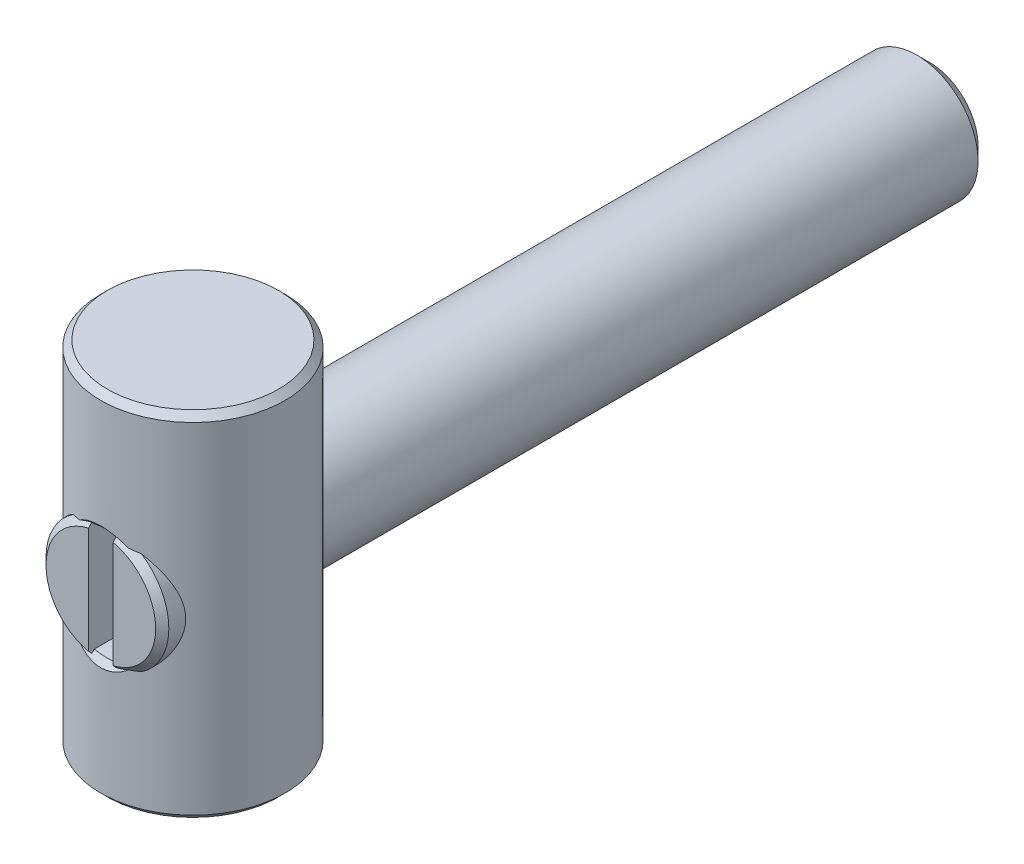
ISO-10303-21;
HEADER;
FILE_DESCRIPTION(('STEP AP214'),'2;1');
FILE_NAME('part.step','',(''),(''),'','','');
FILE_SCHEMA(('AUTOMOTIVE_DESIGN { 1 0 10303 214 1 1 1 1 }'));
ENDSEC;
DATA;
#1=APPLICATION_CONTEXT('core data for automotive mechanical design processes');
#2=APPLICATION_PROTOCOL_DEFINITION('international standard','automotive_design',2000,#1);
#3=PRODUCT_CONTEXT('',#1,'mechanical');
#4=PRODUCT('Part','Part','',(#3));
#5=PRODUCT_RELATED_PRODUCT_CATEGORY('part','',(#4));
#6=PRODUCT_DEFINITION_FORMATION('','',#4);
#7=PRODUCT_DEFINITION_CONTEXT('part definition',#1,'design');
#8=PRODUCT_DEFINITION('design','',#6,#7);
#9=PRODUCT_DEFINITION_SHAPE('','',#8);
#10=(LENGTH_UNIT() NAMED_UNIT(*) SI_UNIT(.MILLI.,.METRE.));
#11=(NAMED_UNIT(*) PLANE_ANGLE_UNIT() SI_UNIT($,.RADIAN.));
#12=(NAMED_UNIT(*) SI_UNIT($,.STERADIAN.) SOLID_ANGLE_UNIT());
#13=UNCERTAINTY_MEASURE_WITH_UNIT(LENGTH_MEASURE(1.E-05),#10,'distance_accuracy_value','');
#14=(GEOMETRIC_REPRESENTATION_CONTEXT(3) GLOBAL_UNCERTAINTY_ASSIGNED_CONTEXT((#13)) GLOBAL_UNIT_ASSIGNED_CONTEXT((#10,
#11,#12)) REPRESENTATION_CONTEXT('',''));
#15=CARTESIAN_POINT('',(0.,0.,0.));
#16=DIRECTION('',(0.,0.,1.));
#17=DIRECTION('',(1.,0.,0.));
#18=AXIS2_PLACEMENT_3D('',#15,#16,#17);
#19=CARTESIAN_POINT('',(0.,0.,-4.));
#20=DIRECTION('',(0.,0.,-1.));
#21=DIRECTION('',(-1.,0.,0.));
#22=AXIS2_PLACEMENT_3D('',#19,#20,#21);
#23=CYLINDRICAL_SURFACE('',#22,2.);
#24=CARTESIAN_POINT('',(1.11399719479,1.6610268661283,2.7855));
#25=CARTESIAN_POINT('',(1.16352046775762,1.62780404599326,2.76569630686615));
#26=CARTESIAN_POINT('',(1.21129322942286,1.59256213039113,2.74505589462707));
#27=CARTESIAN_POINT('',(1.30320814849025,1.51827100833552,2.70263011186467));
#28=CARTESIAN_POINT('',(1.34735150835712,1.47922307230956,2.68084512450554));
#29=CARTESIAN_POINT('',(1.47484746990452,1.35604681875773,2.61420147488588));
#30=CARTESIAN_POINT('',(1.55249324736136,1.26640812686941,2.56837763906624));
#31=CARTESIAN_POINT('',(1.69127884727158,1.07409237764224,2.47919034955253));
#32=CARTESIAN_POINT('',(1.75241552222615,0.971412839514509,2.43582736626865));
#33=CARTESIAN_POINT('',(1.85615019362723,0.754349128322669,2.35773638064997));
#34=CARTESIAN_POINT('',(1.89882852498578,0.640018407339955,2.32297124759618));
#35=CARTESIAN_POINT('',(1.95314493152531,0.438747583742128,2.27729599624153));
#36=CARTESIAN_POINT('',(1.97029467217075,0.354216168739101,2.26233654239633));
#37=CARTESIAN_POINT('',(1.99352675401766,0.182551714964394,2.24189698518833));
#38=CARTESIAN_POINT('',(1.99962325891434,0.0954221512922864,2.23640475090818));
#39=CARTESIAN_POINT('',(2.00034328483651,-0.079061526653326,2.23576112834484));
#40=CARTESIAN_POINT('',(1.99494860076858,-0.166415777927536,2.24062614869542));
#41=CARTESIAN_POINT('',(1.97303463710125,-0.338667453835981,2.25994148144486));
#42=CARTESIAN_POINT('',(1.95650152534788,-0.423561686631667,2.27440371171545));
#43=CARTESIAN_POINT('',(1.90813577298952,-0.608419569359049,2.31521704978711));
#44=CARTESIAN_POINT('',(1.87361856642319,-0.707228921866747,2.34356486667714));
#45=CARTESIAN_POINT('',(1.79082971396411,-0.8964602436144,2.40741595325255));
#46=CARTESIAN_POINT('',(1.7425316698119,-0.986865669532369,2.44293291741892));
#47=CARTESIAN_POINT('',(1.63252243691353,-1.15999565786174,2.51781416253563));
#48=CARTESIAN_POINT('',(1.57057489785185,-1.2425426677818,2.55723849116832));
#49=CARTESIAN_POINT('',(1.43480463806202,-1.39709631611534,2.63580434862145));
#50=CARTESIAN_POINT('',(1.36100810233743,-1.46912554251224,2.67494630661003));
#51=CARTESIAN_POINT('',(1.25497641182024,-1.55764120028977,2.72505273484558));
#52=CARTESIAN_POINT('',(1.22762940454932,-1.57928737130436,2.73749131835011));
#53=CARTESIAN_POINT('',(1.17172197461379,-1.62119899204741,2.76188255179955));
#54=CARTESIAN_POINT('',(1.14316238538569,-1.64146536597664,2.77383552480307));
#55=CARTESIAN_POINT('',(1.11399719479,-1.6610268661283,2.7855));
#56=B_SPLINE_CURVE_WITH_KNOTS('',3,(#24,#25,#26,#27,#28,#29,#30,#31,#32,#33,#34,#35,#36,#37,#38,
#39,#40,#41,#42,#43,#44,#45,#46,#47,#48,#49,#50,#51,#52,#53,#54,#55),.UNSPECIFIED.,.F.,.F.,(4,2,
2,2,2,2,2,2,2,2,2,2,2,2,2,4),(0.,0.188362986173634,0.376663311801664,0.756187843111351,
1.135784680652,1.51371238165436,1.77524600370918,2.03644425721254,2.29805662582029,
2.55999447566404,2.88356492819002,3.20775941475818,3.5380838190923,3.86768804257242,
3.97873730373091,4.08971143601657),.UNSPECIFIED.);
#57=CARTESIAN_POINT('',(1.11399719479,1.6610268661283,2.7855));
#58=VERTEX_POINT('',#57);
#59=CARTESIAN_POINT('',(1.11399719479,-1.6610268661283,2.7855));
#60=VERTEX_POINT('',#59);
#61=EDGE_CURVE('E230',#58,#60,#56,.T.);
#62=ORIENTED_EDGE('',*,*,#61,.F.);
#63=CARTESIAN_POINT('',(0.,0.,2.7855));
#64=DIRECTION('',(0.,0.,-1.));
#65=DIRECTION('',(-1.,0.,0.));
#66=AXIS2_PLACEMENT_3D('',#63,#64,#65);
#67=CIRCLE('',#66,2.);
#68=EDGE_CURVE('E125',#58,#60,#67,.T.);
#69=ORIENTED_EDGE('',*,*,#68,.T.);
#70=EDGE_LOOP('',(#62,#69));
#71=FACE_BOUND('',#70,.T.);
#72=ADVANCED_FACE('F14',(#71),#23,.T.);
#73=CARTESIAN_POINT('',(0.,0.,3.));
#74=DIRECTION('',(0.,0.,-1.));
#75=DIRECTION('',(-1.,0.,0.));
#76=AXIS2_PLACEMENT_3D('',#73,#74,#75);
#77=PLANE('',#76);
#78=DIRECTION('',(0.,-1.,0.));
#79=VECTOR('',#78,1.);
#80=CARTESIAN_POINT('',(-0.4,0.,3.));
#81=LINE('',#80,#79);
#82=CARTESIAN_POINT('',(-0.4,1.74011788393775,3.));
#83=VERTEX_POINT('',#82);
#84=CARTESIAN_POINT('',(-0.4,-1.74011788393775,3.));
#85=VERTEX_POINT('',#84);
#86=EDGE_CURVE('E110',#83,#85,#81,.T.);
#87=ORIENTED_EDGE('',*,*,#86,.F.);
#88=CARTESIAN_POINT('',(0.,0.,3.));
#89=DIRECTION('',(0.,0.,-1.));
#90=DIRECTION('',(-1.,0.,0.));
#91=AXIS2_PLACEMENT_3D('',#88,#89,#90);
#92=CIRCLE('',#91,1.7855);
#93=EDGE_CURVE('E121',#85,#83,#92,.T.);
#94=ORIENTED_EDGE('',*,*,#93,.F.);
#95=EDGE_LOOP('',(#87,#94));
#96=FACE_BOUND('',#95,.T.);
#97=ADVANCED_FACE('F120',(#96),#77,.F.);
#98=CARTESIAN_POINT('',(0.,0.,3.));
#99=DIRECTION('',(0.,0.,-1.));
#100=DIRECTION('',(-1.,0.,0.));
#101=AXIS2_PLACEMENT_3D('',#98,#99,#100);
#102=CONICAL_SURFACE('',#101,1.7855,0.785398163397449);
#103=CARTESIAN_POINT('',(-1.16667612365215,1.65104074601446,2.76385));
#104=CARTESIAN_POINT('',(-1.09329916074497,1.66504476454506,2.79481750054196));
#105=CARTESIAN_POINT('',(-1.01868995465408,1.67914160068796,2.82287437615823));
#106=CARTESIAN_POINT('',(-0.86782079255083,1.70596914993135,2.87283254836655));
#107=CARTESIAN_POINT('',(-0.791576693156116,1.7187090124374,2.89477692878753));
#108=CARTESIAN_POINT('',(-0.637125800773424,1.74152361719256,2.93264181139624));
#109=CARTESIAN_POINT('',(-0.558917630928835,1.75159642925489,2.94855795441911));
#110=CARTESIAN_POINT('',(-0.440293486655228,1.76402293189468,2.96778774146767));
#111=CARTESIAN_POINT('',(-0.400383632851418,1.76772662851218,2.97343575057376));
#112=CARTESIAN_POINT('',(-0.320283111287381,1.77413676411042,2.98312696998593));
#113=CARTESIAN_POINT('',(-0.280092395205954,1.77684302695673,2.98716989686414));
#114=CARTESIAN_POINT('',(-0.2398,1.77901031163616,2.99040063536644));
#115=B_SPLINE_CURVE_WITH_KNOTS('',3,(#103,#104,#105,#106,#107,#108,#109,#110,#111,#112,#113,
#114),.UNSPECIFIED.,.F.,.F.,(4,2,2,2,2,4),(0.,0.242566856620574,0.483378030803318,
0.724363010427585,0.845755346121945,0.967169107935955),.UNSPECIFIED.);
#116=CARTESIAN_POINT('',(-1.11399719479,1.6610268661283,2.7855));
#117=VERTEX_POINT('',#116);
#118=CARTESIAN_POINT('',(-0.794982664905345,1.71770344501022,2.89275));
#119=VERTEX_POINT('',#118);
#120=EDGE_CURVE('E9',#117,#119,#115,.T.);
#121=ORIENTED_EDGE('',*,*,#120,.F.);
#122=CARTESIAN_POINT('',(-1.11399719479,-1.6610268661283,2.7855));
#123=VERTEX_POINT('',#122);
#124=EDGE_CURVE('E130',#123,#117,#67,.T.);
#125=ORIENTED_EDGE('',*,*,#124,.F.);
#126=CARTESIAN_POINT('',(-0.2398,-1.77901031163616,2.99040063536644));
#127=CARTESIAN_POINT('',(-0.280092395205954,-1.77684302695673,2.98716989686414));
#128=CARTESIAN_POINT('',(-0.320283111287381,-1.77413676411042,2.98312696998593));
#129=CARTESIAN_POINT('',(-0.400383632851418,-1.76772662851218,2.97343575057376));
#130=CARTESIAN_POINT('',(-0.440293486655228,-1.76402293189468,2.96778774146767));
#131=CARTESIAN_POINT('',(-0.558917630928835,-1.75159642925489,2.94855795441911));
#132=CARTESIAN_POINT('',(-0.637125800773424,-1.74152361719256,2.93264181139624));
#133=CARTESIAN_POINT('',(-0.791576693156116,-1.7187090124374,2.89477692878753));
#134=CARTESIAN_POINT('',(-0.86782079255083,-1.70596914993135,2.87283254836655));
#135=CARTESIAN_POINT('',(-1.01868995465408,-1.67914160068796,2.82287437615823));
#136=CARTESIAN_POINT('',(-1.09329916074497,-1.66504476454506,2.79481750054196));
#137=CARTESIAN_POINT('',(-1.16667612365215,-1.65104074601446,2.76385));
#138=B_SPLINE_CURVE_WITH_KNOTS('',3,(#126,#127,#128,#129,#130,#131,#132,#133,#134,#135,#136,
#137),.UNSPECIFIED.,.F.,.F.,(4,2,2,2,2,4),(0.,0.12141376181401,0.24280609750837,
0.483791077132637,0.724602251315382,0.967169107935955),.UNSPECIFIED.);
#139=CARTESIAN_POINT('',(-0.794982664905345,-1.71770344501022,2.89275));
#140=VERTEX_POINT('',#139);
#141=EDGE_CURVE('E40',#140,#123,#138,.T.);
#142=ORIENTED_EDGE('',*,*,#141,.F.);
#143=CARTESIAN_POINT('',(0.,0.,2.89275));
#144=DIRECTION('',(0.,0.,1.));
#145=DIRECTION('',(1.,0.,0.));
#146=AXIS2_PLACEMENT_3D('',#143,#144,#145);
#147=CIRCLE('',#146,1.89275);
#148=CARTESIAN_POINT('',(-0.4,-1.85000069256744,2.89275));
#149=VERTEX_POINT('',#148);
#150=EDGE_CURVE('E196',#140,#149,#147,.T.);
#151=ORIENTED_EDGE('',*,*,#150,.T.);
#152=CARTESIAN_POINT('',(-0.4,1.96030622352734,2.7848));
#153=CARTESIAN_POINT('',(-0.4,1.91220040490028,2.83193265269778));
#154=CARTESIAN_POINT('',(-0.4,1.86406179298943,2.87903187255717));
#155=CARTESIAN_POINT('',(-0.4,1.76762008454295,2.97321655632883));
#156=CARTESIAN_POINT('',(-0.4,1.71931684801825,3.02030187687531));
#157=CARTESIAN_POINT('',(-0.4,1.6212885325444,3.11563710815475));
#158=CARTESIAN_POINT('',(-0.4,1.5715604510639,3.16388393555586));
#159=CARTESIAN_POINT('',(-0.4,1.47203148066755,3.26014103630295));
#160=CARTESIAN_POINT('',(-0.4,1.42223083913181,3.30815156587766));
#161=CARTESIAN_POINT('',(-0.4,1.27910635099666,3.44557059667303));
#162=CARTESIAN_POINT('',(-0.4,1.18553880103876,3.53472711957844));
#163=CARTESIAN_POINT('',(-0.4,1.04389226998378,3.66771074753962));
#164=CARTESIAN_POINT('',(-0.4,0.996302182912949,3.71205806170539));
#165=CARTESIAN_POINT('',(-0.4,0.900663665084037,3.80018516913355));
#166=CARTESIAN_POINT('',(-0.4,0.852615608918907,3.84396536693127));
#167=CARTESIAN_POINT('',(-0.4,0.757010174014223,3.9295656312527));
#168=CARTESIAN_POINT('',(-0.4,0.709472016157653,3.97140714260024));
#169=CARTESIAN_POINT('',(-0.4,0.613103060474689,4.05388760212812));
#170=CARTESIAN_POINT('',(-0.4,0.564268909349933,4.0945227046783));
#171=CARTESIAN_POINT('',(-0.4,0.489794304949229,4.15330063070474));
#172=CARTESIAN_POINT('',(-0.4,0.464926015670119,4.17241703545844));
#173=CARTESIAN_POINT('',(-0.4,0.414504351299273,4.2097188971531));
#174=CARTESIAN_POINT('',(-0.4,0.388951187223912,4.22790463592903));
#175=CARTESIAN_POINT('',(-0.4,0.337021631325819,4.26280071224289));
#176=CARTESIAN_POINT('',(-0.4,0.310649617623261,4.27951751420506));
#177=CARTESIAN_POINT('',(-0.4,0.25664656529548,4.31075573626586));
#178=CARTESIAN_POINT('',(-0.4,0.229017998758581,4.32528124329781));
#179=CARTESIAN_POINT('',(-0.4,0.194529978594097,4.34073824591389));
#180=CARTESIAN_POINT('',(-0.4,0.188431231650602,4.34337414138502));
#181=CARTESIAN_POINT('',(-0.4,0.176155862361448,4.34846503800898));
#182=CARTESIAN_POINT('',(-0.4,0.169979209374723,4.35091996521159));
#183=CARTESIAN_POINT('',(-0.4,0.151336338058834,4.35798334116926));
#184=CARTESIAN_POINT('',(-0.4,0.138753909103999,4.36229188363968));
#185=CARTESIAN_POINT('',(-0.4,0.113503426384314,4.36987933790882));
#186=CARTESIAN_POINT('',(-0.4,0.100840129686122,4.37317392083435));
#187=CARTESIAN_POINT('',(-0.4,0.0752707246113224,4.37867100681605));
#188=CARTESIAN_POINT('',(-0.4,0.0623645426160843,4.38087317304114));
#189=CARTESIAN_POINT('',(-0.4,0.0361451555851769,4.38408457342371));
#190=CARTESIAN_POINT('',(-0.4,0.0228289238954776,4.38506967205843));
#191=CARTESIAN_POINT('',(-0.4,-0.00382941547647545,4.38570474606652));
#192=CARTESIAN_POINT('',(-0.4,-0.0171715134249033,4.38535515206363));
#193=CARTESIAN_POINT('',(-0.4,-0.0570913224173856,4.38231129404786));
#194=CARTESIAN_POINT('',(-0.4,-0.0835282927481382,4.37761777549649));
#195=CARTESIAN_POINT('',(-0.4,-0.144402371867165,4.36159805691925));
#196=CARTESIAN_POINT('',(-0.4,-0.178344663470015,4.34850779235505));
#197=CARTESIAN_POINT('',(-0.4,-0.227667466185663,4.32547752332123));
#198=CARTESIAN_POINT('',(-0.4,-0.243900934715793,4.31719757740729));
#199=CARTESIAN_POINT('',(-0.4,-0.275892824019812,4.29976597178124));
#200=CARTESIAN_POINT('',(-0.4,-0.291651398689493,4.29061459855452));
#201=CARTESIAN_POINT('',(-0.4,-0.342427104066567,4.25969743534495));
#202=CARTESIAN_POINT('',(-0.4,-0.376624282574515,4.23660064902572));
#203=CARTESIAN_POINT('',(-0.4,-0.443707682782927,4.18856142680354));
#204=CARTESIAN_POINT('',(-0.4,-0.476592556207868,4.16361716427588));
#205=CARTESIAN_POINT('',(-0.4,-0.541555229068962,4.11253731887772));
#206=CARTESIAN_POINT('',(-0.4,-0.573630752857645,4.08639885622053));
#207=CARTESIAN_POINT('',(-0.4,-0.637167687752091,4.03338342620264));
#208=CARTESIAN_POINT('',(-0.4,-0.668629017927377,4.00650636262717));
#209=CARTESIAN_POINT('',(-0.4,-0.762581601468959,3.92494921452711));
#210=CARTESIAN_POINT('',(-0.4,-0.824422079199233,3.86952173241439));
#211=CARTESIAN_POINT('',(-0.4,-0.947059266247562,3.75773288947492));
#212=CARTESIAN_POINT('',(-0.4,-1.00785750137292,3.70137318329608));
#213=CARTESIAN_POINT('',(-0.4,-1.14419995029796,3.57369126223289));
#214=CARTESIAN_POINT('',(-0.4,-1.21957997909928,3.50219383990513));
#215=CARTESIAN_POINT('',(-0.4,-1.36985690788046,3.35860627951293));
#216=CARTESIAN_POINT('',(-0.4,-1.44475349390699,3.28651581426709));
#217=CARTESIAN_POINT('',(-0.4,-1.59323885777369,3.1429244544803));
#218=CARTESIAN_POINT('',(-0.4,-1.66683198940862,3.07142805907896));
#219=CARTESIAN_POINT('',(-0.4,-1.81374089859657,2.92824339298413));
#220=CARTESIAN_POINT('',(-0.4,-1.88705682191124,2.85655527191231));
#221=CARTESIAN_POINT('',(-0.4,-1.96030622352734,2.7848));
#222=B_SPLINE_CURVE_WITH_KNOTS('',3,(#152,#153,#154,#155,#156,#157,#158,#159,#160,#161,#162,
#163,#164,#165,#166,#167,#168,#169,#170,#171,#172,#173,#174,#175,#176,#177,#178,#179,#180,#181,
#182,#183,#184,#185,#186,#187,#188,#189,#190,#191,#192,#193,#194,#195,#196,#197,#198,#199,#200,
#201,#202,#203,#204,#205,#206,#207,#208,#209,#210,#211,#212,#213,#214,#215,#216,#217,#218,#219,
#220,#221),.UNSPECIFIED.,.F.,.F.,(4,2,2,2,2,2,2,2,2,2,2,2,2,2,2,2,2,2,2,2,2,2,2,2,2,2,2,2,2,2,2,
2,2,2,4),(0.,0.202041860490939,0.404407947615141,0.612267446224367,0.819791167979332,
1.20751042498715,1.40265824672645,1.59765821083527,1.78763722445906,1.97816800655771,
2.07225481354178,2.16631295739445,2.25993394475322,2.35337810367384,2.37330754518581,
2.39324508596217,2.43310931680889,2.47232228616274,2.51154733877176,2.5515383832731,
2.59151652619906,2.67157438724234,2.78007616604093,2.83473709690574,2.88938011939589,
3.0130530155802,3.13684986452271,3.26096287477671,3.38509213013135,3.63419872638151,
3.88290259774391,4.19457948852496,4.50644172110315,4.8142545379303,5.12187303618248),.UNSPECIFIED.);
#223=EDGE_CURVE('E117',#85,#149,#222,.T.);
#224=ORIENTED_EDGE('',*,*,#223,.F.);
#225=ORIENTED_EDGE('',*,*,#93,.T.);
#226=CARTESIAN_POINT('',(-0.4,1.85000069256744,2.89275));
#227=VERTEX_POINT('',#226);
#228=EDGE_CURVE('E106',#227,#83,#222,.T.);
#229=ORIENTED_EDGE('',*,*,#228,.F.);
#230=CARTESIAN_POINT('',(0.,0.,2.89275));
#231=DIRECTION('',(0.,0.,1.));
#232=DIRECTION('',(1.,0.,0.));
#233=AXIS2_PLACEMENT_3D('',#230,#231,#232);
#234=CIRCLE('',#233,1.89275);
#235=EDGE_CURVE('E28',#227,#119,#234,.T.);
#236=ORIENTED_EDGE('',*,*,#235,.T.);
#237=EDGE_LOOP('',(#121,#125,#142,#151,#224,#225,#229,#236));
#238=FACE_BOUND('',#237,.T.);
#239=ADVANCED_FACE('F123',(#238),#102,.T.);
#240=CARTESIAN_POINT('',(0.4,0.,33.));
#241=DIRECTION('',(-1.,0.,0.));
#242=DIRECTION('',(0.,-1.,0.));
#243=AXIS2_PLACEMENT_3D('',#240,#241,#242);
#244=CYLINDRICAL_SURFACE('',#243,31.5);
#245=CARTESIAN_POINT('',(0.4,-1.76576053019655,1.54952957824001));
#246=CARTESIAN_POINT('',(0.349977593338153,-1.77709824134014,1.55016706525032));
#247=CARTESIAN_POINT('',(0.299469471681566,-1.78629930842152,1.55068890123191));
#248=CARTESIAN_POINT('',(0.197847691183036,-1.80038671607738,1.55149171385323));
#249=CARTESIAN_POINT('',(0.146733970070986,-1.8052726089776,1.55177266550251));
#250=CARTESIAN_POINT('',(0.0452193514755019,-1.81063609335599,1.55208115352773));
#251=CARTESIAN_POINT('',(-0.00517737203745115,-1.81119308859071,1.55211325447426));
#252=CARTESIAN_POINT('',(-0.105833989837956,-1.80810483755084,1.55193550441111));
#253=CARTESIAN_POINT('',(-0.156093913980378,-1.8044605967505,1.55172571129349));
#254=CARTESIAN_POINT('',(-0.238696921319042,-1.79499603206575,1.5511843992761));
#255=CARTESIAN_POINT('',(-0.271182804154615,-1.7903758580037,1.55092073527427));
#256=CARTESIAN_POINT('',(-0.335843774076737,-1.77938039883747,1.55029676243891));
#257=CARTESIAN_POINT('',(-0.368018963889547,-1.77300571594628,1.5499364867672));
#258=CARTESIAN_POINT('',(-0.4,-1.76576053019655,1.54952957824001));
#259=B_SPLINE_CURVE_WITH_KNOTS('',3,(#245,#246,#247,#248,#249,#250,#251,#252,#253,#254,#255,
#256,#257,#258),.UNSPECIFIED.,.F.,.F.,(4,2,2,2,2,2,4),(0.,0.153839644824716,0.307695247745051,
0.458721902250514,0.609712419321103,0.708108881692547,0.806471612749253),.UNSPECIFIED.);
#260=CARTESIAN_POINT('',(0.4,-1.76576053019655,1.54952957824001));
#261=VERTEX_POINT('',#260);
#262=CARTESIAN_POINT('',(-0.4,-1.76576053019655,1.54952957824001));
#263=VERTEX_POINT('',#262);
#264=EDGE_CURVE('E345',#261,#263,#259,.T.);
#265=ORIENTED_EDGE('',*,*,#264,.F.);
#266=CARTESIAN_POINT('',(0.4,0.,33.));
#267=DIRECTION('',(1.,0.,0.));
#268=DIRECTION('',(0.,1.,0.));
#269=AXIS2_PLACEMENT_3D('',#266,#267,#268);
#270=CIRCLE('',#269,31.5);
#271=CARTESIAN_POINT('',(0.4,1.76576053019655,1.54952957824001));
#272=VERTEX_POINT('',#271);
#273=EDGE_CURVE('E115',#261,#272,#270,.T.);
#274=ORIENTED_EDGE('',*,*,#273,.T.);
#275=CARTESIAN_POINT('',(-0.4,1.76576053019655,1.54952957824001));
#276=CARTESIAN_POINT('',(-0.349977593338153,1.77709824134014,1.55016706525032));
#277=CARTESIAN_POINT('',(-0.299469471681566,1.78629930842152,1.55068890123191));
#278=CARTESIAN_POINT('',(-0.197847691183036,1.80038671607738,1.55149171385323));
#279=CARTESIAN_POINT('',(-0.146733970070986,1.8052726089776,1.55177266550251));
#280=CARTESIAN_POINT('',(-0.0452193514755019,1.81063609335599,1.55208115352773));
#281=CARTESIAN_POINT('',(0.00517737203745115,1.81119308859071,1.55211325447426));
#282=CARTESIAN_POINT('',(0.105833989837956,1.80810483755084,1.55193550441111));
#283=CARTESIAN_POINT('',(0.156093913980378,1.8044605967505,1.55172571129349));
#284=CARTESIAN_POINT('',(0.238696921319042,1.79499603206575,1.5511843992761));
#285=CARTESIAN_POINT('',(0.271182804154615,1.7903758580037,1.55092073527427));
#286=CARTESIAN_POINT('',(0.335843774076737,1.77938039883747,1.55029676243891));
#287=CARTESIAN_POINT('',(0.368018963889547,1.77300571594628,1.5499364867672));
#288=CARTESIAN_POINT('',(0.4,1.76576053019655,1.54952957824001));
#289=B_SPLINE_CURVE_WITH_KNOTS('',3,(#275,#276,#277,#278,#279,#280,#281,#282,#283,#284,#285,
#286,#287,#288),.UNSPECIFIED.,.F.,.F.,(4,2,2,2,2,2,4),(0.,0.153839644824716,0.307695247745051,
0.458721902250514,0.609712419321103,0.708108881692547,0.806471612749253),.UNSPECIFIED.);
#290=CARTESIAN_POINT('',(-0.4,1.76576053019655,1.54952957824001));
#291=VERTEX_POINT('',#290);
#292=EDGE_CURVE('E194',#291,#272,#289,.T.);
#293=ORIENTED_EDGE('',*,*,#292,.F.);
#294=CARTESIAN_POINT('',(-0.4,0.,33.));
#295=DIRECTION('',(1.,0.,0.));
#296=DIRECTION('',(0.,1.,0.));
#297=AXIS2_PLACEMENT_3D('',#294,#295,#296);
#298=CIRCLE('',#297,31.5);
#299=EDGE_CURVE('E291',#263,#291,#298,.T.);
#300=ORIENTED_EDGE('',*,*,#299,.F.);
#301=EDGE_LOOP('',(#265,#274,#293,#300));
#302=FACE_BOUND('',#301,.T.);
#303=ADVANCED_FACE('F279',(#302),#244,.F.);
#304=CARTESIAN_POINT('',(-0.4,0.,33.));
#305=DIRECTION('',(1.,0.,0.));
#306=DIRECTION('',(0.,1.,0.));
#307=AXIS2_PLACEMENT_3D('',#304,#305,#306);
#308=PLANE('',#307);
#309=CARTESIAN_POINT('',(-0.4,-1.02034635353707,2.09595012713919));
#310=CARTESIAN_POINT('',(-0.4,-1.05950736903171,2.13241722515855));
#311=CARTESIAN_POINT('',(-0.4,-1.09853653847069,2.16902508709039));
#312=CARTESIAN_POINT('',(-0.4,-1.17638543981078,2.24246200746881));
#313=CARTESIAN_POINT('',(-0.4,-1.21520517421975,2.2792910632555));
#314=CARTESIAN_POINT('',(-0.4,-1.33143077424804,2.39001871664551));
#315=CARTESIAN_POINT('',(-0.4,-1.40860528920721,2.46415991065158));
#316=CARTESIAN_POINT('',(-0.4,-1.56257008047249,2.6128326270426));
#317=CARTESIAN_POINT('',(-0.4,-1.6393603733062,2.6873641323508));
#318=CARTESIAN_POINT('',(-0.4,-1.79268710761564,2.83668891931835));
#319=CARTESIAN_POINT('',(-0.4,-1.86922354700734,2.91148220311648));
#320=CARTESIAN_POINT('',(-0.4,-2.0533689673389,3.0918524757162));
#321=CARTESIAN_POINT('',(-0.4,-2.16089223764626,3.19751690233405));
#322=CARTESIAN_POINT('',(-0.4,-2.37571065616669,3.40908334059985));
#323=CARTESIAN_POINT('',(-0.4,-2.48300579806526,3.51498535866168));
#324=CARTESIAN_POINT('',(-0.4,-2.59024265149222,3.62094582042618));
#325=B_SPLINE_CURVE_WITH_KNOTS('',3,(#309,#310,#311,#312,#313,#314,#315,#316,#317,#318,#319,
#320,#321,#322,#323,#324),.UNSPECIFIED.,.F.,.F.,(4,2,2,2,2,2,2,4),(0.,0.160532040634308,
0.321062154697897,0.64211312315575,0.963150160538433,1.2841898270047,1.73644596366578,
2.18871445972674),.UNSPECIFIED.);
#326=CARTESIAN_POINT('',(-0.4,-1.76576053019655,2.8105));
#327=VERTEX_POINT('',#326);
#328=EDGE_CURVE('E180',#327,#149,#325,.T.);
#329=ORIENTED_EDGE('',*,*,#328,.F.);
#330=DIRECTION('',(0.,0.,-1.));
#331=VECTOR('',#330,1.);
#332=CARTESIAN_POINT('',(-0.4,-1.76576053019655,-3.));
#333=LINE('',#332,#331);
#334=EDGE_CURVE('E142',#263,#327,#333,.F.);
#335=ORIENTED_EDGE('',*,*,#334,.F.);
#336=ORIENTED_EDGE('',*,*,#299,.T.);
#337=DIRECTION('',(0.,0.,-1.));
#338=VECTOR('',#337,1.);
#339=CARTESIAN_POINT('',(-0.4,1.76576053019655,-3.));
#340=LINE('',#339,#338);
#341=CARTESIAN_POINT('',(-0.4,1.76576053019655,2.8105));
#342=VERTEX_POINT('',#341);
#343=EDGE_CURVE('E128',#342,#291,#340,.T.);
#344=ORIENTED_EDGE('',*,*,#343,.F.);
#345=CARTESIAN_POINT('',(-0.4,2.59024265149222,3.62094582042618));
#346=CARTESIAN_POINT('',(-0.4,2.46048935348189,3.49276389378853));
#347=CARTESIAN_POINT('',(-0.4,2.33066988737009,3.3646473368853));
#348=CARTESIAN_POINT('',(-0.4,2.0706621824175,3.10879920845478));
#349=CARTESIAN_POINT('',(-0.4,1.9404739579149,2.98106762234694));
#350=CARTESIAN_POINT('',(-0.4,1.74472718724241,2.78993924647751));
#351=CARTESIAN_POINT('',(-0.4,1.67939930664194,2.72630645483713));
#352=CARTESIAN_POINT('',(-0.4,1.5485207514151,2.59927137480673));
#353=CARTESIAN_POINT('',(-0.4,1.48297007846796,2.5358690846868));
#354=CARTESIAN_POINT('',(-0.4,1.35155357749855,2.40938546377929));
#355=CARTESIAN_POINT('',(-0.4,1.285687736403,2.34630414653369));
#356=CARTESIAN_POINT('',(-0.4,1.15344707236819,2.22067435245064));
#357=CARTESIAN_POINT('',(-0.4,1.08707223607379,2.15812588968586));
#358=CARTESIAN_POINT('',(-0.4,1.02034635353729,2.09595012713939));
#359=B_SPLINE_CURVE_WITH_KNOTS('',3,(#345,#346,#347,#348,#349,#350,#351,#352,#353,#354,#355,
#356,#357,#358),.UNSPECIFIED.,.F.,.F.,(4,2,2,2,2,2,4),(0.,0.54717523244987,1.09432947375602,
1.36791954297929,1.6415075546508,1.91510701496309,2.18871367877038),.UNSPECIFIED.);
#360=EDGE_CURVE('E113',#227,#342,#359,.T.);
#361=ORIENTED_EDGE('',*,*,#360,.F.);
#362=ORIENTED_EDGE('',*,*,#228,.T.);
#363=ORIENTED_EDGE('',*,*,#86,.T.);
#364=ORIENTED_EDGE('',*,*,#223,.T.);
#365=EDGE_LOOP('',(#329,#335,#336,#344,#361,#362,#363,#364));
#366=FACE_BOUND('',#365,.T.);
#367=ADVANCED_FACE('F108',(#366),#308,.T.);
#368=CARTESIAN_POINT('',(0.4,1.74011788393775,3.));
#369=VERTEX_POINT('',#368);
#370=CARTESIAN_POINT('',(0.4,-1.74011788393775,3.));
#371=VERTEX_POINT('',#370);
#372=EDGE_CURVE('E124',#369,#371,#92,.T.);
#373=ORIENTED_EDGE('',*,*,#372,.F.);
#374=DIRECTION('',(0.,-1.,0.));
#375=VECTOR('',#374,1.);
#376=CARTESIAN_POINT('',(0.4,0.,3.));
#377=LINE('',#376,#375);
#378=EDGE_CURVE('E335',#369,#371,#377,.T.);
#379=ORIENTED_EDGE('',*,*,#378,.T.);
#380=EDGE_LOOP('',(#373,#379));
#381=FACE_BOUND('',#380,.T.);
#382=ADVANCED_FACE('F280',(#381),#77,.F.);
#383=CARTESIAN_POINT('',(0.2398,1.77901031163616,2.99040063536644));
#384=CARTESIAN_POINT('',(0.280092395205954,1.77684302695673,2.98716989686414));
#385=CARTESIAN_POINT('',(0.320283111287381,1.77413676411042,2.98312696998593));
#386=CARTESIAN_POINT('',(0.400383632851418,1.76772662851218,2.97343575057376));
#387=CARTESIAN_POINT('',(0.440293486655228,1.76402293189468,2.96778774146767));
#388=CARTESIAN_POINT('',(0.558917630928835,1.75159642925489,2.94855795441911));
#389=CARTESIAN_POINT('',(0.637125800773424,1.74152361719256,2.93264181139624));
#390=CARTESIAN_POINT('',(0.791576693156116,1.7187090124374,2.89477692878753));
#391=CARTESIAN_POINT('',(0.86782079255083,1.70596914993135,2.87283254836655));
#392=CARTESIAN_POINT('',(1.01868995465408,1.67914160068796,2.82287437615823));
#393=CARTESIAN_POINT('',(1.09329916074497,1.66504476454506,2.79481750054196));
#394=CARTESIAN_POINT('',(1.16667612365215,1.65104074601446,2.76385));
#395=B_SPLINE_CURVE_WITH_KNOTS('',3,(#383,#384,#385,#386,#387,#388,#389,#390,#391,#392,#393,
#394),.UNSPECIFIED.,.F.,.F.,(4,2,2,2,2,4),(0.,0.12141376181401,0.24280609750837,
0.483791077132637,0.724602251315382,0.967169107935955),.UNSPECIFIED.);
#396=CARTESIAN_POINT('',(0.794982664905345,1.71770344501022,2.89275));
#397=VERTEX_POINT('',#396);
#398=EDGE_CURVE('E228',#397,#58,#395,.T.);
#399=ORIENTED_EDGE('',*,*,#398,.F.);
#400=CARTESIAN_POINT('',(0.,0.,2.89275));
#401=DIRECTION('',(0.,0.,1.));
#402=DIRECTION('',(1.,0.,0.));
#403=AXIS2_PLACEMENT_3D('',#400,#401,#402);
#404=CIRCLE('',#403,1.89275);
#405=CARTESIAN_POINT('',(0.4,1.85000069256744,2.89275));
#406=VERTEX_POINT('',#405);
#407=EDGE_CURVE('E225',#397,#406,#404,.T.);
#408=ORIENTED_EDGE('',*,*,#407,.T.);
#409=CARTESIAN_POINT('',(0.4,1.96030622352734,2.7848));
#410=CARTESIAN_POINT('',(0.4,1.91220040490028,2.83193265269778));
#411=CARTESIAN_POINT('',(0.4,1.86406179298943,2.87903187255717));
#412=CARTESIAN_POINT('',(0.4,1.76762008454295,2.97321655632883));
#413=CARTESIAN_POINT('',(0.4,1.71931684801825,3.02030187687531));
#414=CARTESIAN_POINT('',(0.4,1.6212885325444,3.11563710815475));
#415=CARTESIAN_POINT('',(0.4,1.5715604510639,3.16388393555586));
#416=CARTESIAN_POINT('',(0.4,1.47203148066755,3.26014103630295));
#417=CARTESIAN_POINT('',(0.4,1.42223083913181,3.30815156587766));
#418=CARTESIAN_POINT('',(0.4,1.27910635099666,3.44557059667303));
#419=CARTESIAN_POINT('',(0.4,1.18553880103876,3.53472711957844));
#420=CARTESIAN_POINT('',(0.4,1.04389226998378,3.66771074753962));
#421=CARTESIAN_POINT('',(0.4,0.996302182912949,3.71205806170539));
#422=CARTESIAN_POINT('',(0.4,0.900663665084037,3.80018516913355));
#423=CARTESIAN_POINT('',(0.4,0.852615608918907,3.84396536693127));
#424=CARTESIAN_POINT('',(0.4,0.757010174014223,3.9295656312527));
#425=CARTESIAN_POINT('',(0.4,0.709472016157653,3.97140714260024));
#426=CARTESIAN_POINT('',(0.4,0.613103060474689,4.05388760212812));
#427=CARTESIAN_POINT('',(0.4,0.564268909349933,4.0945227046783));
#428=CARTESIAN_POINT('',(0.4,0.489794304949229,4.15330063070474));
#429=CARTESIAN_POINT('',(0.4,0.464926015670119,4.17241703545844));
#430=CARTESIAN_POINT('',(0.4,0.414504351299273,4.2097188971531));
#431=CARTESIAN_POINT('',(0.4,0.388951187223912,4.22790463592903));
#432=CARTESIAN_POINT('',(0.4,0.337021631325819,4.26280071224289));
#433=CARTESIAN_POINT('',(0.4,0.310649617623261,4.27951751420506));
#434=CARTESIAN_POINT('',(0.4,0.25664656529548,4.31075573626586));
#435=CARTESIAN_POINT('',(0.4,0.229017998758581,4.32528124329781));
#436=CARTESIAN_POINT('',(0.4,0.194529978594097,4.34073824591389));
#437=CARTESIAN_POINT('',(0.4,0.188431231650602,4.34337414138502));
#438=CARTESIAN_POINT('',(0.4,0.176155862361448,4.34846503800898));
#439=CARTESIAN_POINT('',(0.4,0.169979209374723,4.35091996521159));
#440=CARTESIAN_POINT('',(0.4,0.151336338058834,4.35798334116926));
#441=CARTESIAN_POINT('',(0.4,0.138753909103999,4.36229188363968));
#442=CARTESIAN_POINT('',(0.4,0.113503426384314,4.36987933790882));
#443=CARTESIAN_POINT('',(0.4,0.100840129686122,4.37317392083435));
#444=CARTESIAN_POINT('',(0.4,0.0752707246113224,4.37867100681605));
#445=CARTESIAN_POINT('',(0.4,0.0623645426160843,4.38087317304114));
#446=CARTESIAN_POINT('',(0.4,0.0361451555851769,4.38408457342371));
#447=CARTESIAN_POINT('',(0.4,0.0228289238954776,4.38506967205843));
#448=CARTESIAN_POINT('',(0.4,-0.00382941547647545,4.38570474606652));
#449=CARTESIAN_POINT('',(0.4,-0.0171715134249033,4.38535515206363));
#450=CARTESIAN_POINT('',(0.4,-0.0570913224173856,4.38231129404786));
#451=CARTESIAN_POINT('',(0.4,-0.0835282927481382,4.37761777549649));
#452=CARTESIAN_POINT('',(0.4,-0.144402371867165,4.36159805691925));
#453=CARTESIAN_POINT('',(0.4,-0.178344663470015,4.34850779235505));
#454=CARTESIAN_POINT('',(0.4,-0.227667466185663,4.32547752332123));
#455=CARTESIAN_POINT('',(0.4,-0.243900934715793,4.31719757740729));
#456=CARTESIAN_POINT('',(0.4,-0.275892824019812,4.29976597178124));
#457=CARTESIAN_POINT('',(0.4,-0.291651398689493,4.29061459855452));
#458=CARTESIAN_POINT('',(0.4,-0.342427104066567,4.25969743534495));
#459=CARTESIAN_POINT('',(0.4,-0.376624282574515,4.23660064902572));
#460=CARTESIAN_POINT('',(0.4,-0.443707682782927,4.18856142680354));
#461=CARTESIAN_POINT('',(0.4,-0.476592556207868,4.16361716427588));
#462=CARTESIAN_POINT('',(0.4,-0.541555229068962,4.11253731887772));
#463=CARTESIAN_POINT('',(0.4,-0.573630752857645,4.08639885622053));
#464=CARTESIAN_POINT('',(0.4,-0.637167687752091,4.03338342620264));
#465=CARTESIAN_POINT('',(0.4,-0.668629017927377,4.00650636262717));
#466=CARTESIAN_POINT('',(0.4,-0.762581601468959,3.92494921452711));
#467=CARTESIAN_POINT('',(0.4,-0.824422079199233,3.86952173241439));
#468=CARTESIAN_POINT('',(0.4,-0.947059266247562,3.75773288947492));
#469=CARTESIAN_POINT('',(0.4,-1.00785750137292,3.70137318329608));
#470=CARTESIAN_POINT('',(0.4,-1.14419995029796,3.57369126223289));
#471=CARTESIAN_POINT('',(0.4,-1.21957997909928,3.50219383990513));
#472=CARTESIAN_POINT('',(0.4,-1.36985690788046,3.35860627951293));
#473=CARTESIAN_POINT('',(0.4,-1.44475349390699,3.28651581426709));
#474=CARTESIAN_POINT('',(0.4,-1.59323885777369,3.1429244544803));
#475=CARTESIAN_POINT('',(0.4,-1.66683198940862,3.07142805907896));
#476=CARTESIAN_POINT('',(0.4,-1.81374089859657,2.92824339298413));
#477=CARTESIAN_POINT('',(0.4,-1.88705682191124,2.85655527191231));
#478=CARTESIAN_POINT('',(0.4,-1.96030622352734,2.7848));
#479=B_SPLINE_CURVE_WITH_KNOTS('',3,(#409,#410,#411,#412,#413,#414,#415,#416,#417,#418,#419,
#420,#421,#422,#423,#424,#425,#426,#427,#428,#429,#430,#431,#432,#433,#434,#435,#436,#437,#438,
#439,#440,#441,#442,#443,#444,#445,#446,#447,#448,#449,#450,#451,#452,#453,#454,#455,#456,#457,
#458,#459,#460,#461,#462,#463,#464,#465,#466,#467,#468,#469,#470,#471,#472,#473,#474,#475,#476,
#477,#478),.UNSPECIFIED.,.F.,.F.,(4,2,2,2,2,2,2,2,2,2,2,2,2,2,2,2,2,2,2,2,2,2,2,2,2,2,2,2,2,2,2,
2,2,2,4),(0.,0.202041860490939,0.404407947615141,0.612267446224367,0.819791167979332,
1.20751042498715,1.40265824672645,1.59765821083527,1.78763722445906,1.97816800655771,
2.07225481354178,2.16631295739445,2.25993394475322,2.35337810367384,2.37330754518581,
2.39324508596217,2.43310931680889,2.47232228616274,2.51154733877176,2.5515383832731,
2.59151652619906,2.67157438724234,2.78007616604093,2.83473709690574,2.88938011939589,
3.0130530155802,3.13684986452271,3.26096287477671,3.38509213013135,3.63419872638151,
3.88290259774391,4.19457948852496,4.50644172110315,4.8142545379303,5.12187303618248),.UNSPECIFIED.);
#480=EDGE_CURVE('E212',#406,#369,#479,.T.);
#481=ORIENTED_EDGE('',*,*,#480,.T.);
#482=ORIENTED_EDGE('',*,*,#372,.T.);
#483=CARTESIAN_POINT('',(0.4,-1.85000069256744,2.89275));
#484=VERTEX_POINT('',#483);
#485=EDGE_CURVE('E333',#371,#484,#479,.T.);
#486=ORIENTED_EDGE('',*,*,#485,.T.);
#487=CARTESIAN_POINT('',(0.,0.,2.89275));
#488=DIRECTION('',(0.,0.,1.));
#489=DIRECTION('',(1.,0.,0.));
#490=AXIS2_PLACEMENT_3D('',#487,#488,#489);
#491=CIRCLE('',#490,1.89275);
#492=CARTESIAN_POINT('',(0.794982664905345,-1.71770344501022,2.89275));
#493=VERTEX_POINT('',#492);
#494=EDGE_CURVE('E198',#484,#493,#491,.T.);
#495=ORIENTED_EDGE('',*,*,#494,.T.);
#496=CARTESIAN_POINT('',(1.16667612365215,-1.65104074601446,2.76385));
#497=CARTESIAN_POINT('',(1.09329916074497,-1.66504476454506,2.79481750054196));
#498=CARTESIAN_POINT('',(1.01868995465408,-1.67914160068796,2.82287437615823));
#499=CARTESIAN_POINT('',(0.86782079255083,-1.70596914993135,2.87283254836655));
#500=CARTESIAN_POINT('',(0.791576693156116,-1.7187090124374,2.89477692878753));
#501=CARTESIAN_POINT('',(0.637125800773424,-1.74152361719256,2.93264181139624));
#502=CARTESIAN_POINT('',(0.558917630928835,-1.75159642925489,2.94855795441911));
#503=CARTESIAN_POINT('',(0.440293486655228,-1.76402293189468,2.96778774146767));
#504=CARTESIAN_POINT('',(0.400383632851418,-1.76772662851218,2.97343575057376));
#505=CARTESIAN_POINT('',(0.320283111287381,-1.77413676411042,2.98312696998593));
#506=CARTESIAN_POINT('',(0.280092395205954,-1.77684302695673,2.98716989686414));
#507=CARTESIAN_POINT('',(0.2398,-1.77901031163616,2.99040063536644));
#508=B_SPLINE_CURVE_WITH_KNOTS('',3,(#496,#497,#498,#499,#500,#501,#502,#503,#504,#505,#506,
#507),.UNSPECIFIED.,.F.,.F.,(4,2,2,2,2,4),(0.,0.242566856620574,0.483378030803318,
0.724363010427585,0.845755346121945,0.967169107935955),.UNSPECIFIED.);
#509=EDGE_CURVE('E229',#60,#493,#508,.T.);
#510=ORIENTED_EDGE('',*,*,#509,.F.);
#511=ORIENTED_EDGE('',*,*,#68,.F.);
#512=EDGE_LOOP('',(#399,#408,#481,#482,#486,#495,#510,#511));
#513=FACE_BOUND('',#512,.T.);
#514=ADVANCED_FACE('F205',(#513),#102,.T.);
#515=CARTESIAN_POINT('',(0.4,0.,33.));
#516=DIRECTION('',(1.,0.,0.));
#517=DIRECTION('',(0.,1.,0.));
#518=AXIS2_PLACEMENT_3D('',#515,#516,#517);
#519=PLANE('',#518);
#520=DIRECTION('',(0.,0.,-1.));
#521=VECTOR('',#520,1.);
#522=CARTESIAN_POINT('',(0.4,-1.76576053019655,-3.));
#523=LINE('',#522,#521);
#524=CARTESIAN_POINT('',(0.4,-1.76576053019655,2.8105));
#525=VERTEX_POINT('',#524);
#526=EDGE_CURVE('E195',#261,#525,#523,.F.);
#527=ORIENTED_EDGE('',*,*,#526,.T.);
#528=CARTESIAN_POINT('',(0.4,-1.02034635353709,2.0959501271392));
#529=CARTESIAN_POINT('',(0.4,-1.05950736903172,2.13241722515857));
#530=CARTESIAN_POINT('',(0.4,-1.09853653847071,2.16902508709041));
#531=CARTESIAN_POINT('',(0.4,-1.1763854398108,2.24246200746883));
#532=CARTESIAN_POINT('',(0.4,-1.21520517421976,2.27929106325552));
#533=CARTESIAN_POINT('',(0.4,-1.33143077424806,2.39001871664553));
#534=CARTESIAN_POINT('',(0.4,-1.40860528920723,2.4641599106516));
#535=CARTESIAN_POINT('',(0.4,-1.56257008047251,2.61283262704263));
#536=CARTESIAN_POINT('',(0.4,-1.63936037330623,2.68736413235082));
#537=CARTESIAN_POINT('',(0.4,-1.79268710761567,2.83668891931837));
#538=CARTESIAN_POINT('',(0.4,-1.86922354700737,2.9114822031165));
#539=CARTESIAN_POINT('',(0.4,-2.05336896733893,3.09185247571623));
#540=CARTESIAN_POINT('',(0.4,-2.16089223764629,3.19751690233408));
#541=CARTESIAN_POINT('',(0.4,-2.3757106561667,3.40908334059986));
#542=CARTESIAN_POINT('',(0.4,-2.48300579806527,3.51498535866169));
#543=CARTESIAN_POINT('',(0.4,-2.59024265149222,3.62094582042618));
#544=B_SPLINE_CURVE_WITH_KNOTS('',3,(#528,#529,#530,#531,#532,#533,#534,#535,#536,#537,#538,
#539,#540,#541,#542,#543),.UNSPECIFIED.,.F.,.F.,(4,2,2,2,2,2,2,4),(0.,0.16053204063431,
0.321062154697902,0.64211312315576,0.963150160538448,1.28418982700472,1.73644596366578,
2.18871445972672),.UNSPECIFIED.);
#545=EDGE_CURVE('E187',#525,#484,#544,.T.);
#546=ORIENTED_EDGE('',*,*,#545,.T.);
#547=ORIENTED_EDGE('',*,*,#485,.F.);
#548=ORIENTED_EDGE('',*,*,#378,.F.);
#549=ORIENTED_EDGE('',*,*,#480,.F.);
#550=CARTESIAN_POINT('',(0.4,2.59024265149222,3.62094582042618));
#551=CARTESIAN_POINT('',(0.4,2.46048935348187,3.49276389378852));
#552=CARTESIAN_POINT('',(0.4,2.33066988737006,3.36464733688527));
#553=CARTESIAN_POINT('',(0.4,2.07066218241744,3.10879920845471));
#554=CARTESIAN_POINT('',(0.4,1.94047395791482,2.98106762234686));
#555=CARTESIAN_POINT('',(0.4,1.7447271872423,2.7899392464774));
#556=CARTESIAN_POINT('',(0.4,1.67939930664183,2.72630645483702));
#557=CARTESIAN_POINT('',(0.4,1.54852075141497,2.5992713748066));
#558=CARTESIAN_POINT('',(0.4,1.48297007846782,2.53586908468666));
#559=CARTESIAN_POINT('',(0.4,1.35155357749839,2.40938546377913));
#560=CARTESIAN_POINT('',(0.4,1.28568773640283,2.34630414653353));
#561=CARTESIAN_POINT('',(0.4,1.153447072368,2.22067435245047));
#562=CARTESIAN_POINT('',(0.4,1.0870722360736,2.15812588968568));
#563=CARTESIAN_POINT('',(0.4,1.02034635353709,2.0959501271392));
#564=B_SPLINE_CURVE_WITH_KNOTS('',3,(#550,#551,#552,#553,#554,#555,#556,#557,#558,#559,#560,
#561,#562,#563),.UNSPECIFIED.,.F.,.F.,(4,2,2,2,2,2,4),(0.,0.54717523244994,1.09432947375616,
1.36791954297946,1.64150755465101,1.91510701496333,2.18871367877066),.UNSPECIFIED.);
#565=CARTESIAN_POINT('',(0.4,1.76576053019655,2.8105));
#566=VERTEX_POINT('',#565);
#567=EDGE_CURVE('E217',#406,#566,#564,.T.);
#568=ORIENTED_EDGE('',*,*,#567,.T.);
#569=DIRECTION('',(0.,0.,-1.));
#570=VECTOR('',#569,1.);
#571=CARTESIAN_POINT('',(0.4,1.76576053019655,-3.));
#572=LINE('',#571,#570);
#573=EDGE_CURVE('E224',#566,#272,#572,.T.);
#574=ORIENTED_EDGE('',*,*,#573,.T.);
#575=ORIENTED_EDGE('',*,*,#273,.F.);
#576=EDGE_LOOP('',(#527,#546,#547,#548,#549,#568,#574,#575));
#577=FACE_BOUND('',#576,.T.);
#578=ADVANCED_FACE('F200',(#577),#519,.F.);
#579=CARTESIAN_POINT('',(-1.11399719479,-1.6610268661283,2.7855));
#580=CARTESIAN_POINT('',(-1.16352046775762,-1.62780404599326,2.76569630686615));
#581=CARTESIAN_POINT('',(-1.21129322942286,-1.59256213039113,2.74505589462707));
#582=CARTESIAN_POINT('',(-1.30320814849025,-1.51827100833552,2.70263011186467));
#583=CARTESIAN_POINT('',(-1.34735150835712,-1.47922307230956,2.68084512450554));
#584=CARTESIAN_POINT('',(-1.47484746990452,-1.35604681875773,2.61420147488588));
#585=CARTESIAN_POINT('',(-1.55249324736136,-1.26640812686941,2.56837763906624));
#586=CARTESIAN_POINT('',(-1.69127884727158,-1.07409237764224,2.47919034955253));
#587=CARTESIAN_POINT('',(-1.75241552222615,-0.971412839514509,2.43582736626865));
#588=CARTESIAN_POINT('',(-1.85615019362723,-0.754349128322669,2.35773638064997));
#589=CARTESIAN_POINT('',(-1.89882852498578,-0.640018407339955,2.32297124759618));
#590=CARTESIAN_POINT('',(-1.95314493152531,-0.438747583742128,2.27729599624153));
#591=CARTESIAN_POINT('',(-1.97029467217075,-0.354216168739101,2.26233654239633));
#592=CARTESIAN_POINT('',(-1.99352675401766,-0.182551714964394,2.24189698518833));
#593=CARTESIAN_POINT('',(-1.99962325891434,-0.0954221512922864,2.23640475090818));
#594=CARTESIAN_POINT('',(-2.00034328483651,0.079061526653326,2.23576112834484));
#595=CARTESIAN_POINT('',(-1.99494860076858,0.166415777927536,2.24062614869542));
#596=CARTESIAN_POINT('',(-1.97303463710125,0.338667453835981,2.25994148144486));
#597=CARTESIAN_POINT('',(-1.95650152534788,0.423561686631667,2.27440371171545));
#598=CARTESIAN_POINT('',(-1.90813577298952,0.608419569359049,2.31521704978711));
#599=CARTESIAN_POINT('',(-1.87361856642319,0.707228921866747,2.34356486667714));
#600=CARTESIAN_POINT('',(-1.79082971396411,0.8964602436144,2.40741595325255));
#601=CARTESIAN_POINT('',(-1.7425316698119,0.986865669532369,2.44293291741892));
#602=CARTESIAN_POINT('',(-1.63252243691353,1.15999565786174,2.51781416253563));
#603=CARTESIAN_POINT('',(-1.57057489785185,1.2425426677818,2.55723849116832));
#604=CARTESIAN_POINT('',(-1.43480463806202,1.39709631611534,2.63580434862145));
#605=CARTESIAN_POINT('',(-1.36100810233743,1.46912554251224,2.67494630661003));
#606=CARTESIAN_POINT('',(-1.25497641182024,1.55764120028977,2.72505273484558));
#607=CARTESIAN_POINT('',(-1.22762940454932,1.57928737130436,2.73749131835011));
#608=CARTESIAN_POINT('',(-1.17172197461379,1.62119899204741,2.76188255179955));
#609=CARTESIAN_POINT('',(-1.14316238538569,1.64146536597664,2.77383552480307));
#610=CARTESIAN_POINT('',(-1.11399719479,1.6610268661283,2.7855));
#611=B_SPLINE_CURVE_WITH_KNOTS('',3,(#579,#580,#581,#582,#583,#584,#585,#586,#587,#588,#589,
#590,#591,#592,#593,#594,#595,#596,#597,#598,#599,#600,#601,#602,#603,#604,#605,#606,#607,#608,
#609,#610),.UNSPECIFIED.,.F.,.F.,(4,2,2,2,2,2,2,2,2,2,2,2,2,2,2,4),(0.,0.188362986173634,
0.376663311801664,0.756187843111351,1.135784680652,1.51371238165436,1.77524600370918,
2.03644425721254,2.29805662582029,2.55999447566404,2.88356492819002,3.20775941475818,
3.5380838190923,3.86768804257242,3.97873730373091,4.08971143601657),.UNSPECIFIED.);
#612=EDGE_CURVE('E237',#123,#117,#611,.T.);
#613=ORIENTED_EDGE('',*,*,#612,.F.);
#614=ORIENTED_EDGE('',*,*,#124,.T.);
#615=EDGE_LOOP('',(#613,#614));
#616=FACE_BOUND('',#615,.T.);
#617=ADVANCED_FACE('F204',(#616),#23,.T.);
#618=CARTESIAN_POINT('',(-2.,0.,-2.23606797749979));
#619=CARTESIAN_POINT('',(-1.99999453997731,-0.0976283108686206,-2.23607753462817));
#620=CARTESIAN_POINT('',(-1.99278992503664,-0.195290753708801,-2.24258071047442));
#621=CARTESIAN_POINT('',(-1.96458268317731,-0.387119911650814,-2.26731972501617));
#622=CARTESIAN_POINT('',(-1.94355530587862,-0.481280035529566,-2.2855766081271));
#623=CARTESIAN_POINT('',(-1.88935861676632,-0.662735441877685,-2.3305658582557));
#624=CARTESIAN_POINT('',(-1.85630718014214,-0.750087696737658,-2.35721561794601));
#625=CARTESIAN_POINT('',(-1.77934008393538,-0.917865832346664,-2.41584094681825));
#626=CARTESIAN_POINT('',(-1.73542216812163,-0.998290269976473,-2.44781762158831));
#627=CARTESIAN_POINT('',(-1.63002410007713,-1.16364688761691,-2.51946072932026));
#628=CARTESIAN_POINT('',(-1.56687435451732,-1.2473321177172,-2.55954936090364));
#629=CARTESIAN_POINT('',(-1.4281921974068,-1.40400270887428,-2.63944827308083));
#630=CARTESIAN_POINT('',(-1.3526477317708,-1.47697752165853,-2.67925824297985));
#631=CARTESIAN_POINT('',(-1.17815690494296,-1.62064365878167,-2.76088818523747));
#632=CARTESIAN_POINT('',(-1.07740643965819,-1.68948251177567,-2.80216785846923));
#633=CARTESIAN_POINT('',(-0.862470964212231,-1.80864209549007,-2.87558484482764));
#634=CARTESIAN_POINT('',(-0.748301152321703,-1.85898351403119,-2.90773236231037));
#635=CARTESIAN_POINT('',(-0.523249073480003,-1.93355640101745,-2.95599907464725));
#636=CARTESIAN_POINT('',(-0.413434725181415,-1.96008334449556,-2.97351175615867));
#637=CARTESIAN_POINT('',(-0.189695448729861,-1.99418448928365,-2.99609745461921));
#638=CARTESIAN_POINT('',(-0.0757758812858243,-2.00178255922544,-3.00118613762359));
#639=CARTESIAN_POINT('',(0.13414705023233,-1.99782755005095,-2.99855361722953));
#640=CARTESIAN_POINT('',(0.230240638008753,-1.98901094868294,-2.99266264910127));
#641=CARTESIAN_POINT('',(0.419238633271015,-1.95790894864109,-2.9720818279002));
#642=CARTESIAN_POINT('',(0.512142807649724,-1.93562256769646,-2.95739133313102));
#643=CARTESIAN_POINT('',(0.692077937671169,-1.87880431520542,-2.92052091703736));
#644=CARTESIAN_POINT('',(0.779130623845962,-1.84432111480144,-2.89837077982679));
#645=CARTESIAN_POINT('',(0.946209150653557,-1.76444635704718,-2.84821104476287));
#646=CARTESIAN_POINT('',(1.0262337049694,-1.71905280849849,-2.82020037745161));
#647=CARTESIAN_POINT('',(1.18828429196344,-1.61202126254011,-2.75618058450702));
#648=CARTESIAN_POINT('',(1.26919148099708,-1.54903247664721,-2.71960408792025));
#649=CARTESIAN_POINT('',(1.41998807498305,-1.41210132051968,-2.64400601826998));
#650=CARTESIAN_POINT('',(1.48986013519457,-1.33814205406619,-2.60498072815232));
#651=CARTESIAN_POINT('',(1.62772235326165,-1.16803678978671,-2.52150044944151));
#652=CARTESIAN_POINT('',(1.69373593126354,-1.07022892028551,-2.47714320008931));
#653=CARTESIAN_POINT('',(1.80834874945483,-0.862490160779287,-2.39475610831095));
#654=CARTESIAN_POINT('',(1.85697718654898,-0.752580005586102,-2.3567157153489));
#655=CARTESIAN_POINT('',(1.92332724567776,-0.555280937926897,-2.30262870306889));
#656=CARTESIAN_POINT('',(1.94590791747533,-0.470406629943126,-2.28340364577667));
#657=CARTESIAN_POINT('',(1.97979555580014,-0.296960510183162,-2.25409039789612));
#658=CARTESIAN_POINT('',(1.99112206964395,-0.208395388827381,-2.24398636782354));
#659=CARTESIAN_POINT('',(2.00179400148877,-0.0295570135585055,-2.23447556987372));
#660=CARTESIAN_POINT('',(2.00108729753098,0.0607219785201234,-2.2351153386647));
#661=CARTESIAN_POINT('',(1.98761629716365,0.239683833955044,-2.24709880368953));
#662=CARTESIAN_POINT('',(1.97484222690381,0.328365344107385,-2.25845117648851));
#663=CARTESIAN_POINT('',(1.93899811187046,0.497389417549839,-2.28927977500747));
#664=CARTESIAN_POINT('',(1.91646174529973,0.577927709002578,-2.30833187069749));
#665=CARTESIAN_POINT('',(1.86223041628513,0.734126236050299,-2.3522995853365));
#666=CARTESIAN_POINT('',(1.83053237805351,0.809784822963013,-2.3772171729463));
#667=CARTESIAN_POINT('',(1.75163346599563,0.97020200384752,-2.43611483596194));
#668=CARTESIAN_POINT('',(1.70260028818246,1.05375681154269,-2.47091081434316));
#669=CARTESIAN_POINT('',(1.59352731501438,1.21241680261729,-2.54262514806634));
#670=CARTESIAN_POINT('',(1.53347411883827,1.28751151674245,-2.57954604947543));
#671=CARTESIAN_POINT('',(1.38876657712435,1.44396234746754,-2.66075678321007));
#672=CARTESIAN_POINT('',(1.30160386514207,1.52310284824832,-2.70489452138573));
#673=CARTESIAN_POINT('',(1.11309948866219,1.66581668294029,-2.78775581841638));
#674=CARTESIAN_POINT('',(1.011770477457,1.72940377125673,-2.82648414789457));
#675=CARTESIAN_POINT('',(0.817487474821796,1.82789173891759,-2.88790821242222));
#676=CARTESIAN_POINT('',(0.726662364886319,1.86595650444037,-2.91225458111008));
#677=CARTESIAN_POINT('',(0.538757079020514,1.92860719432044,-2.95278707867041));
#678=CARTESIAN_POINT('',(0.441682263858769,1.95320450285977,-2.96898009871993));
#679=CARTESIAN_POINT('',(0.243369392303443,1.98769696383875,-2.99178364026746));
#680=CARTESIAN_POINT('',(0.142114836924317,1.99752667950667,-2.99835150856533));
#681=CARTESIAN_POINT('',(-0.0608555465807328,2.00164785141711,-3.00109821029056));
#682=CARTESIAN_POINT('',(-0.162571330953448,1.99594075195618,-2.99727800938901));
#683=CARTESIAN_POINT('',(-0.355757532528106,1.9703405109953,-2.98029555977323));
#684=CARTESIAN_POINT('',(-0.44743514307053,1.95150901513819,-2.96783277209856));
#685=CARTESIAN_POINT('',(-0.626018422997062,1.9017619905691,-2.93536106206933));
#686=CARTESIAN_POINT('',(-0.71292334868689,1.87084458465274,-2.91535096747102));
#687=CARTESIAN_POINT('',(-0.885147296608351,1.79606129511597,-2.86791765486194));
#688=CARTESIAN_POINT('',(-0.970083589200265,1.75154969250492,-2.84013248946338));
#689=CARTESIAN_POINT('',(-1.13155266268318,1.65184935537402,-2.77975408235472));
#690=CARTESIAN_POINT('',(-1.20808037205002,1.596654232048,-2.74715796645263));
#691=CARTESIAN_POINT('',(-1.36329422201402,1.46737109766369,-2.67392931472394));
#692=CARTESIAN_POINT('',(-1.44042679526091,1.39167697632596,-2.6328391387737));
#693=CARTESIAN_POINT('',(-1.58160022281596,1.22888645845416,-2.55053357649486));
#694=CARTESIAN_POINT('',(-1.64563128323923,1.14178161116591,-2.50931811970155));
#695=CARTESIAN_POINT('',(-1.75513253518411,0.964132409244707,-2.43384213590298));
#696=CARTESIAN_POINT('',(-1.8016464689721,0.874358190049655,-2.39929086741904));
#697=CARTESIAN_POINT('',(-1.88115802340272,0.686715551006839,-2.33747501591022));
#698=CARTESIAN_POINT('',(-1.91418190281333,0.588863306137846,-2.31019631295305));
#699=CARTESIAN_POINT('',(-1.95936262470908,0.40922853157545,-2.27191051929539));
#700=CARTESIAN_POINT('',(-1.97452228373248,0.328691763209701,-2.25863695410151));
#701=CARTESIAN_POINT('',(-1.99483915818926,0.165443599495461,-2.24071519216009));
#702=CARTESIAN_POINT('',(-2.00000462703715,0.0827340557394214,-2.23605987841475));
#703=CARTESIAN_POINT('',(-2.,0.,-2.23606797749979));
#704=B_SPLINE_CURVE_WITH_KNOTS('',3,(#618,#619,#620,#621,#622,#623,#624,#625,#626,#627,#628,
#629,#630,#631,#632,#633,#634,#635,#636,#637,#638,#639,#640,#641,#642,#643,#644,#645,#646,#647,
#648,#649,#650,#651,#652,#653,#654,#655,#656,#657,#658,#659,#660,#661,#662,#663,#664,#665,#666,
#667,#668,#669,#670,#671,#672,#673,#674,#675,#676,#677,#678,#679,#680,#681,#682,#683,#684,#685,
#686,#687,#688,#689,#690,#691,#692,#693,#694,#695,#696,#697,#698,#699,#700,#701,#702,#703),
.UNSPECIFIED.,.T.,.F.,(4,2,2,2,2,2,2,2,2,2,2,2,2,2,2,2,2,2,2,2,2,2,2,2,2,2,2,2,2,2,2,2,2,2,2,2,
2,2,2,2,2,2,4),(0.,0.292506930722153,0.585539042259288,0.875772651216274,1.16606657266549,
1.50154677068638,1.83735518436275,2.22167031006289,2.6055542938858,2.9463748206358,
3.28676536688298,3.57539534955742,3.86404638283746,4.15155831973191,4.43912276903,
4.76447525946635,5.09033414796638,5.46678703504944,5.84260469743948,6.11126090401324,
6.37944966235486,6.64880037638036,6.91836943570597,7.17476451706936,7.43124577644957,
7.73899230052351,8.04711556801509,8.42254684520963,8.7976449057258,9.10070580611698,
9.40351012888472,9.70765229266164,10.0117661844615,10.2937678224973,10.5758132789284,
10.874178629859,11.1727229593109,11.5182220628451,11.863978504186,12.1833412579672,
12.5020793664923,12.7501661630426,12.9980479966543),.UNSPECIFIED.);
#705=CARTESIAN_POINT('',(-2.,0.,-2.23606797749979));
#706=VERTEX_POINT('',#705);
#707=EDGE_CURVE('E238',#706,#706,#704,.T.);
#708=ORIENTED_EDGE('',*,*,#707,.F.);
#709=EDGE_LOOP('',(#708));
#710=FACE_BOUND('',#709,.T.);
#711=CARTESIAN_POINT('',(0.,0.,-23.5705));
#712=DIRECTION('',(0.,0.,-1.));
#713=DIRECTION('',(-1.,0.,0.));
#714=AXIS2_PLACEMENT_3D('',#711,#712,#713);
#715=CIRCLE('',#714,2.);
#716=CARTESIAN_POINT('',(-2.,0.,-23.5705));
#717=VERTEX_POINT('',#716);
#718=EDGE_CURVE('E296',#717,#717,#715,.T.);
#719=ORIENTED_EDGE('',*,*,#718,.F.);
#720=EDGE_LOOP('',(#719));
#721=FACE_BOUND('',#720,.T.);
#722=ADVANCED_FACE('F372',(#710,#721),#23,.T.);
#723=CARTESIAN_POINT('',(0.,-5.75,0.));
#724=DIRECTION('',(0.,1.,0.));
#725=DIRECTION('',(-1.,0.,0.));
#726=AXIS2_PLACEMENT_3D('',#723,#724,#725);
#727=PLANE('',#726);
#728=CARTESIAN_POINT('',(0.,-5.75,0.));
#729=DIRECTION('',(0.,1.,0.));
#730=DIRECTION('',(-1.,0.,0.));
#731=AXIS2_PLACEMENT_3D('',#728,#729,#730);
#732=CIRCLE('',#731,2.78786796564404);
#733=CARTESIAN_POINT('',(-2.78786796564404,-5.75,0.));
#734=VERTEX_POINT('',#733);
#735=EDGE_CURVE('E317',#734,#734,#732,.T.);
#736=ORIENTED_EDGE('',*,*,#735,.F.);
#737=EDGE_LOOP('',(#736));
#738=FACE_BOUND('',#737,.T.);
#739=ADVANCED_FACE('F16',(#738),#727,.F.);
#740=CARTESIAN_POINT('',(0.,5.75,2.78786796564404));
#741=DIRECTION('',(0.,-1.,0.));
#742=DIRECTION('',(1.,0.,0.));
#743=AXIS2_PLACEMENT_3D('',#740,#741,#742);
#744=PLANE('',#743);
#745=CARTESIAN_POINT('',(0.,5.75,0.));
#746=DIRECTION('',(0.,1.,0.));
#747=DIRECTION('',(-1.,0.,0.));
#748=AXIS2_PLACEMENT_3D('',#745,#746,#747);
#749=CIRCLE('',#748,2.78786796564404);
#750=CARTESIAN_POINT('',(-2.78786796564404,5.75,0.));
#751=VERTEX_POINT('',#750);
#752=EDGE_CURVE('E308',#751,#751,#749,.T.);
#753=ORIENTED_EDGE('',*,*,#752,.T.);
#754=EDGE_LOOP('',(#753));
#755=FACE_BOUND('',#754,.T.);
#756=ADVANCED_FACE('F158',(#755),#744,.F.);
#757=CARTESIAN_POINT('',(0.,-5.75,0.));
#758=DIRECTION('',(0.,1.,0.));
#759=DIRECTION('',(-1.,0.,0.));
#760=AXIS2_PLACEMENT_3D('',#757,#758,#759);
#761=CONICAL_SURFACE('',#760,2.78786796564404,0.785398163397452);
#762=CARTESIAN_POINT('',(0.,-5.53786796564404,0.));
#763=DIRECTION('',(0.,1.,0.));
#764=DIRECTION('',(-1.,0.,0.));
#765=AXIS2_PLACEMENT_3D('',#762,#763,#764);
#766=CIRCLE('',#765,3.);
#767=CARTESIAN_POINT('',(-3.,-5.53786796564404,0.));
#768=VERTEX_POINT('',#767);
#769=EDGE_CURVE('E315',#768,#768,#766,.T.);
#770=ORIENTED_EDGE('',*,*,#769,.F.);
#771=EDGE_LOOP('',(#770));
#772=FACE_BOUND('',#771,.T.);
#773=ORIENTED_EDGE('',*,*,#735,.T.);
#774=EDGE_LOOP('',(#773));
#775=FACE_BOUND('',#774,.T.);
#776=ADVANCED_FACE('F249',(#772,#775),#761,.T.);
#777=CARTESIAN_POINT('',(0.,5.53786796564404,0.));
#778=DIRECTION('',(0.,-1.,0.));
#779=DIRECTION('',(1.,0.,0.));
#780=AXIS2_PLACEMENT_3D('',#777,#778,#779);
#781=CONICAL_SURFACE('',#780,3.,0.785398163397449);
#782=ORIENTED_EDGE('',*,*,#752,.F.);
#783=EDGE_LOOP('',(#782));
#784=FACE_BOUND('',#783,.T.);
#785=CARTESIAN_POINT('',(0.,5.53786796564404,0.));
#786=DIRECTION('',(0.,1.,0.));
#787=DIRECTION('',(-1.,0.,0.));
#788=AXIS2_PLACEMENT_3D('',#785,#786,#787);
#789=CIRCLE('',#788,3.);
#790=CARTESIAN_POINT('',(-3.,5.53786796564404,0.));
#791=VERTEX_POINT('',#790);
#792=EDGE_CURVE('E312',#791,#791,#789,.T.);
#793=ORIENTED_EDGE('',*,*,#792,.T.);
#794=EDGE_LOOP('',(#793));
#795=FACE_BOUND('',#794,.T.);
#796=ADVANCED_FACE('F247',(#784,#795),#781,.T.);
#797=CARTESIAN_POINT('',(0.,5.75,0.));
#798=DIRECTION('',(0.,1.,0.));
#799=DIRECTION('',(-1.,0.,0.));
#800=AXIS2_PLACEMENT_3D('',#797,#798,#799);
#801=CYLINDRICAL_SURFACE('',#800,3.);
#802=ORIENTED_EDGE('',*,*,#792,.F.);
#803=EDGE_LOOP('',(#802));
#804=FACE_BOUND('',#803,.T.);
#805=ORIENTED_EDGE('',*,*,#769,.T.);
#806=EDGE_LOOP('',(#805));
#807=FACE_BOUND('',#806,.T.);
#808=ORIENTED_EDGE('',*,*,#707,.T.);
#809=EDGE_LOOP('',(#808));
#810=FACE_BOUND('',#809,.T.);
#811=ORIENTED_EDGE('',*,*,#612,.T.);
#812=ORIENTED_EDGE('',*,*,#120,.T.);
#813=CARTESIAN_POINT('',(1.09925664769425,1.41441494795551,2.79135));
#814=CARTESIAN_POINT('',(1.04642247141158,1.48181130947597,2.81214295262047));
#815=CARTESIAN_POINT('',(0.988790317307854,1.54583259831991,2.83311881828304));
#816=CARTESIAN_POINT('',(0.863621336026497,1.66502262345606,2.87376928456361));
#817=CARTESIAN_POINT('',(0.796000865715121,1.7201074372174,2.89343063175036));
#818=CARTESIAN_POINT('',(0.665066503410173,1.80883072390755,2.92597512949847));
#819=CARTESIAN_POINT('',(0.603329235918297,1.84455406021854,2.93943777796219));
#820=CARTESIAN_POINT('',(0.474621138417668,1.90598572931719,2.96293658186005));
#821=CARTESIAN_POINT('',(0.407667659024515,1.93172569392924,2.97298354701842));
#822=CARTESIAN_POINT('',(0.269194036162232,1.97172403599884,2.98871574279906));
#823=CARTESIAN_POINT('',(0.197638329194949,1.98587739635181,2.99436105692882));
#824=CARTESIAN_POINT('',(0.0528867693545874,2.00102671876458,3.00040642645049));
#825=CARTESIAN_POINT('',(-0.0203090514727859,2.00202293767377,3.00080658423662));
#826=CARTESIAN_POINT('',(-0.156588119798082,1.9914684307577,2.99659130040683));
#827=CARTESIAN_POINT('',(-0.219815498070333,1.98143385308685,2.99258190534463));
#828=CARTESIAN_POINT('',(-0.343622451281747,1.95190193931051,2.98090431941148));
#829=CARTESIAN_POINT('',(-0.404202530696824,1.93240641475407,2.9732368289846));
#830=CARTESIAN_POINT('',(-0.523378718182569,1.88436313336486,2.95462931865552));
#831=CARTESIAN_POINT('',(-0.581849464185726,1.85554588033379,2.94359250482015));
#832=CARTESIAN_POINT('',(-0.694026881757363,1.79043493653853,2.91918325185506));
#833=CARTESIAN_POINT('',(-0.747724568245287,1.75412755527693,2.90580654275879));
#834=CARTESIAN_POINT('',(-0.855414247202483,1.67114714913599,2.87605992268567));
#835=CARTESIAN_POINT('',(-0.908818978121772,1.62377976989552,2.8595228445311));
#836=CARTESIAN_POINT('',(-1.00894329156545,1.52317651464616,2.82573776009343));
#837=CARTESIAN_POINT('',(-1.05569752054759,1.46997381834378,2.80849409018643));
#838=CARTESIAN_POINT('',(-1.09925664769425,1.41441494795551,2.79135));
#839=B_SPLINE_CURVE_WITH_KNOTS('',3,(#813,#814,#815,#816,#817,#818,#819,#820,#821,#822,#823,
#824,#825,#826,#827,#828,#829,#830,#831,#832,#833,#834,#835,#836,#837,#838),.UNSPECIFIED.,.F.,
.F.,(4,2,2,2,2,2,2,2,2,2,2,2,4),(0.,0.264726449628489,0.531810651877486,0.748730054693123,
0.96495643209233,1.18312156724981,1.40128244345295,1.59282328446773,1.78432746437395,
1.9819545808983,2.17994617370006,2.39919290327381,2.61725196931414),.UNSPECIFIED.);
#840=EDGE_CURVE('E173',#397,#119,#839,.T.);
#841=ORIENTED_EDGE('',*,*,#840,.F.);
#842=ORIENTED_EDGE('',*,*,#398,.T.);
#843=ORIENTED_EDGE('',*,*,#61,.T.);
#844=ORIENTED_EDGE('',*,*,#509,.T.);
#845=CARTESIAN_POINT('',(-1.09925664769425,-1.41441494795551,2.79135));
#846=CARTESIAN_POINT('',(-1.04642247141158,-1.48181130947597,2.81214295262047));
#847=CARTESIAN_POINT('',(-0.988790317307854,-1.54583259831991,2.83311881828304));
#848=CARTESIAN_POINT('',(-0.863621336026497,-1.66502262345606,2.87376928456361));
#849=CARTESIAN_POINT('',(-0.796000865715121,-1.7201074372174,2.89343063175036));
#850=CARTESIAN_POINT('',(-0.665066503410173,-1.80883072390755,2.92597512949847));
#851=CARTESIAN_POINT('',(-0.603329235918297,-1.84455406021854,2.93943777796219));
#852=CARTESIAN_POINT('',(-0.474621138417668,-1.90598572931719,2.96293658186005));
#853=CARTESIAN_POINT('',(-0.407667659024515,-1.93172569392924,2.97298354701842));
#854=CARTESIAN_POINT('',(-0.269194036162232,-1.97172403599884,2.98871574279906));
#855=CARTESIAN_POINT('',(-0.197638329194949,-1.98587739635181,2.99436105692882));
#856=CARTESIAN_POINT('',(-0.0528867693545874,-2.00102671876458,3.00040642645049));
#857=CARTESIAN_POINT('',(0.0203090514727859,-2.00202293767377,3.00080658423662));
#858=CARTESIAN_POINT('',(0.156588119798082,-1.9914684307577,2.99659130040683));
#859=CARTESIAN_POINT('',(0.219815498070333,-1.98143385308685,2.99258190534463));
#860=CARTESIAN_POINT('',(0.343622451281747,-1.95190193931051,2.98090431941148));
#861=CARTESIAN_POINT('',(0.404202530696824,-1.93240641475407,2.9732368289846));
#862=CARTESIAN_POINT('',(0.523378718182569,-1.88436313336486,2.95462931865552));
#863=CARTESIAN_POINT('',(0.581849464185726,-1.85554588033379,2.94359250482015));
#864=CARTESIAN_POINT('',(0.694026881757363,-1.79043493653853,2.91918325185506));
#865=CARTESIAN_POINT('',(0.747724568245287,-1.75412755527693,2.90580654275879));
#866=CARTESIAN_POINT('',(0.855414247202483,-1.67114714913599,2.87605992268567));
#867=CARTESIAN_POINT('',(0.908818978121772,-1.62377976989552,2.8595228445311));
#868=CARTESIAN_POINT('',(1.00894329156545,-1.52317651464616,2.82573776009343));
#869=CARTESIAN_POINT('',(1.05569752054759,-1.46997381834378,2.80849409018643));
#870=CARTESIAN_POINT('',(1.09925664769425,-1.41441494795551,2.79135));
#871=B_SPLINE_CURVE_WITH_KNOTS('',3,(#845,#846,#847,#848,#849,#850,#851,#852,#853,#854,#855,
#856,#857,#858,#859,#860,#861,#862,#863,#864,#865,#866,#867,#868,#869,#870),.UNSPECIFIED.,.F.,
.F.,(4,2,2,2,2,2,2,2,2,2,2,2,4),(0.,0.264726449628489,0.531810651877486,0.748730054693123,
0.96495643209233,1.18312156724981,1.40128244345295,1.59282328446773,1.78432746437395,
1.9819545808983,2.17994617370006,2.39919290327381,2.61725196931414),.UNSPECIFIED.);
#872=EDGE_CURVE('E163',#140,#493,#871,.T.);
#873=ORIENTED_EDGE('',*,*,#872,.F.);
#874=ORIENTED_EDGE('',*,*,#141,.T.);
#875=EDGE_LOOP('',(#811,#812,#841,#842,#843,#844,#873,#874));
#876=FACE_BOUND('',#875,.T.);
#877=ADVANCED_FACE('F244',(#804,#807,#810,#876),#801,.T.);
#878=CARTESIAN_POINT('',(0.,0.,3.));
#879=DIRECTION('',(0.,0.,1.));
#880=DIRECTION('',(1.,0.,0.));
#881=AXIS2_PLACEMENT_3D('',#878,#879,#880);
#882=CONICAL_SURFACE('',#881,2.,0.785398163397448);
#883=ORIENTED_EDGE('',*,*,#494,.F.);
#884=ORIENTED_EDGE('',*,*,#545,.F.);
#885=CARTESIAN_POINT('',(0.,0.,2.8105));
#886=DIRECTION('',(0.,0.,-1.));
#887=DIRECTION('',(-1.,0.,0.));
#888=AXIS2_PLACEMENT_3D('',#885,#886,#887);
#889=CIRCLE('',#888,1.8105);
#890=EDGE_CURVE('E305',#525,#327,#889,.T.);
#891=ORIENTED_EDGE('',*,*,#890,.T.);
#892=ORIENTED_EDGE('',*,*,#328,.T.);
#893=ORIENTED_EDGE('',*,*,#150,.F.);
#894=ORIENTED_EDGE('',*,*,#872,.T.);
#895=EDGE_LOOP('',(#883,#884,#891,#892,#893,#894));
#896=FACE_BOUND('',#895,.T.);
#897=ADVANCED_FACE('F155',(#896),#882,.F.);
#898=CARTESIAN_POINT('',(0.,0.,-3.));
#899=DIRECTION('',(0.,0.,-1.));
#900=DIRECTION('',(-1.,0.,0.));
#901=AXIS2_PLACEMENT_3D('',#898,#899,#900);
#902=CYLINDRICAL_SURFACE('',#901,1.8105);
#903=ORIENTED_EDGE('',*,*,#526,.F.);
#904=ORIENTED_EDGE('',*,*,#264,.T.);
#905=ORIENTED_EDGE('',*,*,#334,.T.);
#906=ORIENTED_EDGE('',*,*,#890,.F.);
#907=EDGE_LOOP('',(#903,#904,#905,#906));
#908=FACE_BOUND('',#907,.T.);
#909=ADVANCED_FACE('F153',(#908),#902,.F.);
#910=ORIENTED_EDGE('',*,*,#407,.F.);
#911=ORIENTED_EDGE('',*,*,#840,.T.);
#912=ORIENTED_EDGE('',*,*,#235,.F.);
#913=ORIENTED_EDGE('',*,*,#360,.T.);
#914=EDGE_CURVE('E301',#342,#566,#889,.T.);
#915=ORIENTED_EDGE('',*,*,#914,.T.);
#916=ORIENTED_EDGE('',*,*,#567,.F.);
#917=EDGE_LOOP('',(#910,#911,#912,#913,#915,#916));
#918=FACE_BOUND('',#917,.T.);
#919=ADVANCED_FACE('F147',(#918),#882,.F.);
#920=ORIENTED_EDGE('',*,*,#573,.F.);
#921=ORIENTED_EDGE('',*,*,#914,.F.);
#922=ORIENTED_EDGE('',*,*,#343,.T.);
#923=ORIENTED_EDGE('',*,*,#292,.T.);
#924=EDGE_LOOP('',(#920,#921,#922,#923));
#925=FACE_BOUND('',#924,.T.);
#926=ADVANCED_FACE('F152',(#925),#902,.F.);
#927=CARTESIAN_POINT('',(-1.5705,0.,-24.));
#928=DIRECTION('',(0.,0.,1.));
#929=DIRECTION('',(1.,0.,0.));
#930=AXIS2_PLACEMENT_3D('',#927,#928,#929);
#931=PLANE('',#930);
#932=CARTESIAN_POINT('',(0.,0.,-24.));
#933=DIRECTION('',(0.,0.,-1.));
#934=DIRECTION('',(-1.,0.,0.));
#935=AXIS2_PLACEMENT_3D('',#932,#933,#934);
#936=CIRCLE('',#935,1.5705);
#937=CARTESIAN_POINT('',(-1.5705,0.,-24.));
#938=VERTEX_POINT('',#937);
#939=EDGE_CURVE('E299',#938,#938,#936,.T.);
#940=ORIENTED_EDGE('',*,*,#939,.T.);
#941=EDGE_LOOP('',(#940));
#942=FACE_BOUND('',#941,.T.);
#943=ADVANCED_FACE('F207',(#942),#931,.F.);
#944=CARTESIAN_POINT('',(0.,0.,-23.5705));
#945=DIRECTION('',(0.,0.,1.));
#946=DIRECTION('',(1.,0.,0.));
#947=AXIS2_PLACEMENT_3D('',#944,#945,#946);
#948=CONICAL_SURFACE('',#947,2.,0.785398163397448);
#949=ORIENTED_EDGE('',*,*,#939,.F.);
#950=EDGE_LOOP('',(#949));
#951=FACE_BOUND('',#950,.T.);
#952=ORIENTED_EDGE('',*,*,#718,.T.);
#953=EDGE_LOOP('',(#952));
#954=FACE_BOUND('',#953,.T.);
#955=ADVANCED_FACE('F377',(#951,#954),#948,.T.);
#956=CLOSED_SHELL('',(#72,#97,#239,#303,#367,#382,#514,#578,#617,#722,#739,#756,#776,#796,#877,
#897,#909,#919,#926,#943,#955));
#957=MANIFOLD_SOLID_BREP('B1',#956);
#958=ADVANCED_BREP_SHAPE_REPRESENTATION('',(#18,#957),#14);
#959=SHAPE_DEFINITION_REPRESENTATION(#9,#958);
ENDSEC;
END-ISO-10303-21;
